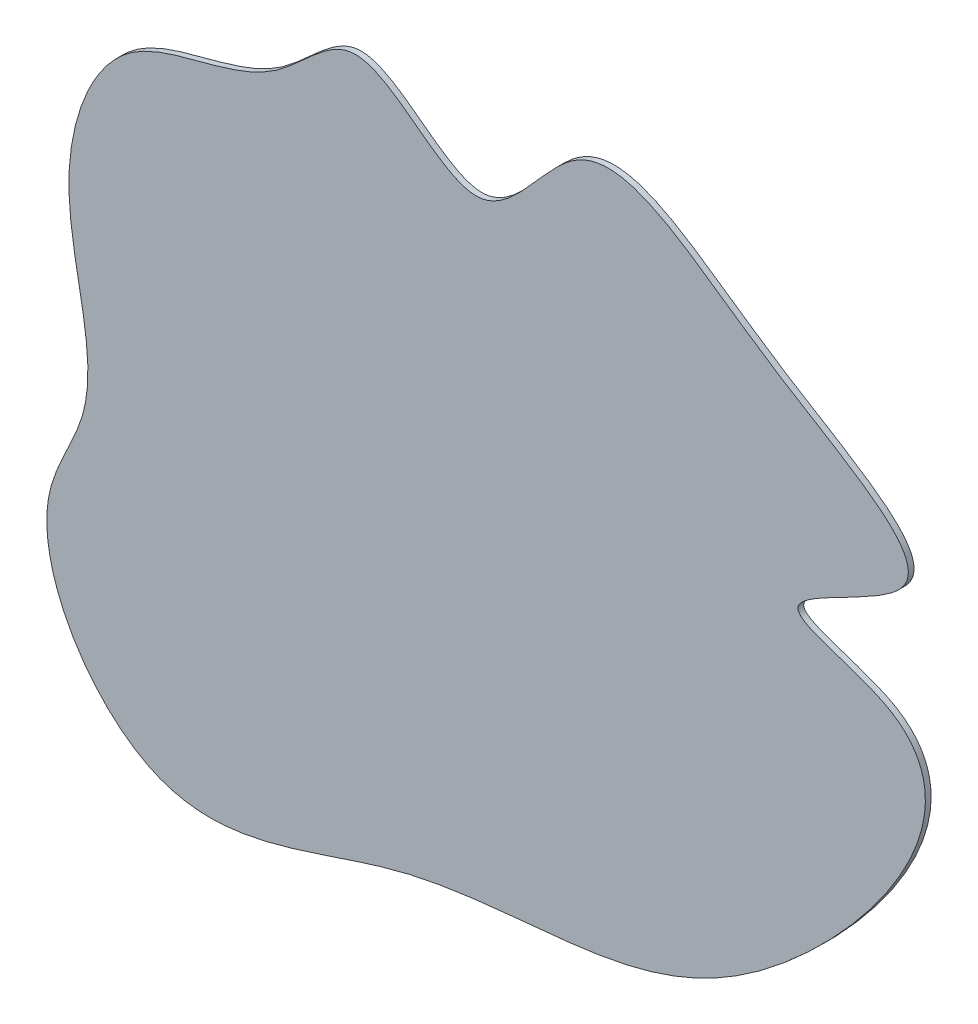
from build123d import *

# Parameters (mm, degrees)
EXTRUSION1_DEPTH = 1


with BuildPart() as part:
    # Esquisse1 → Extrusion1 (new body)
    with BuildSketch(Plane.XY):
        with BuildLine():
            add(Edge.make_bspline(
                [(-21.661404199, 34.054872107), (-29.68881627, 28.41271766), (-49.835468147, 29.48904977), (-62.391909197, -3.58124952), (-49.573504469, -29.228616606), (-67.803584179, -55.185611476), (-42.802548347, -95.143511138), (-1.730499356, -71.943136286), (37.385001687, -72.963206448), (70.622595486, -58.037450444), (106.897469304, -9.732262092), (56.91584776, -2.276697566), (103.098267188, 12.042979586), (58.380278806, 33.156324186), (33.033698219, 58.865678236), (13.507817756, 22.142056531), (-6.869237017, 51.338124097), (-16.852241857, 37.435044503), (-21.661404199, 34.054872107)],
                knots=[0, 0, 0, 0, 0.057182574, 0.112713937, 0.185714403, 0.219037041, 0.298383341, 0.389371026, 0.469137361, 0.539977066, 0.643888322, 0.680328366, 0.725797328, 0.790807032, 0.870930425, 0.914966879, 0.965742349, 1, 1, 1, 1], degree=3))
        make_face()
    extrude(amount=EXTRUSION1_DEPTH)


solid = part.part
